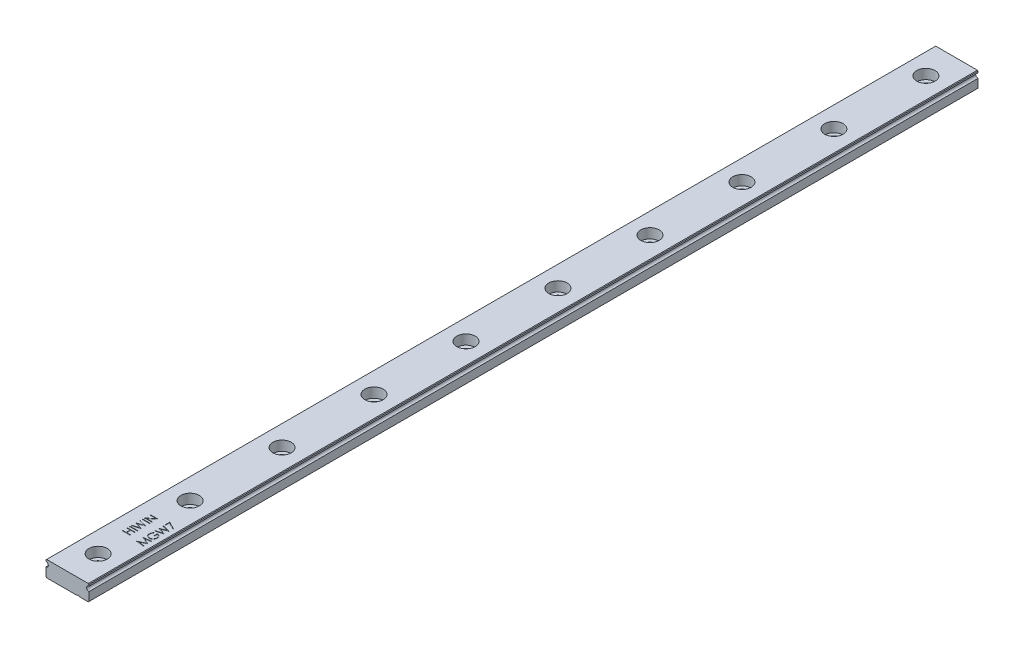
from build123d import *

# Parameters (mm, degrees)
EXTRUDE_1_DEPTH              = 290
HOLE_WIZARD_M3_1_D           = 3.5
HOLE_WIZARD_M3_1_CBORE_D     = 6
HOLE_WIZARD_M3_1_CBORE_DEPTH = 3.2
PATTERN_LINEAR_1_COUNT       = 10
PATTERN_LINEAR_1_PITCH       = 30
SKETCH_4_W                   = 2.5
SKETCH_4_H                   = 0.224358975
SKETCH_4_H_2                 = 0.224358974
CUT_EXTRUDE_1_DEPTH          = 0.1


with BuildPart() as part:
    # Sketch 1 → Extrude 1 (new body)
    with BuildSketch(Plane.XY):
        with BuildLine():
            Line((6.8, 5.2), (-6.8, 5.2))
            Line((-6.8, 5.2), (-7, 5))
            Line((-7, 5), (-7, 4.5))
            ThreePointArc((-7, 4.5), (-6.25, 3.75), (-7, 3))
            Line((-7, 3), (-7, 0.2))
            Line((-7, 0.2), (-6.8, 0))
            Line((-6.8, 0), (3.2, 0))
            ThreePointArc((3.2, 0), (3.5, 0.3), (3.8, 0))
            Line((3.8, 0), (6.8, 0))
            Line((6.8, 0), (7, 0.2))
            Line((7, 0.2), (7, 3))
            ThreePointArc((7, 3), (6.25, 3.75), (7, 4.5))
            Line((7, 4.5), (7, 5))
            Line((7, 5), (6.8, 5.2))
        make_face()
    extrude(amount=-EXTRUDE_1_DEPTH)

    # Hole Wizard M3 _1 (through all)
    with Locations(Plane(origin=(-1.59728338, 5.2, -94.560513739), x_dir=(-1, 0, 0), z_dir=(0, 1, 0))):
        with Locations((-1.59728338, 84.560513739)):
            hole_wizard_m3_1 = CounterBoreHole(HOLE_WIZARD_M3_1_D / 2, HOLE_WIZARD_M3_1_CBORE_D / 2, HOLE_WIZARD_M3_1_CBORE_DEPTH)

    # Pattern Linear 1: Hole Wizard M3 _1 ×10
    with Locations(*[(0, 0, -i * PATTERN_LINEAR_1_PITCH) for i in range(1, PATTERN_LINEAR_1_COUNT)]):
        add(hole_wizard_m3_1, mode=Mode.SUBTRACT)

    # Sketch 4 → Cut-Extrude 1 (cut)
    with BuildSketch(Plane(origin=(0, 5.2, 0), x_dir=(1, 0, 0), z_dir=(0, 1, 0))):
        Polygon((-2.5, 20.384615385), (-2.5, 20.608974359), (-1.474358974, 20.608974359), (-1.474358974, 21.891025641), (-2.5, 21.891025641), (-2.5, 22.115384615), (0, 22.115384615), (0, 21.891025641), (-1.217948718, 21.891025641), (-1.217948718, 20.608974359), (0, 20.608974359), (0, 20.384615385), align=None)
        with Locations((-1.25, 22.868589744)):
            Rectangle(SKETCH_4_W, SKETCH_4_H)
        Polygon((-2.5, 23.365384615), (-2.5, 23.597255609), (-0.666566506, 24.086538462), (-2.5, 24.814202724), (-2.5, 24.846754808), (-0.679086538, 25.560897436), (-2.5, 26.052684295), (-2.5, 26.282051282), (0, 25.607972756), (0, 25.575921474), (-1.912059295, 24.823717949), (0, 24.0625), (0, 24.030448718), align=None)
        with Locations((-1.25, 26.971153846)):
            Rectangle(SKETCH_4_W, SKETCH_4_H_2)
        Polygon((0, 27.628205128), (-2.5, 27.628205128), (-2.5, 27.675280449), (-0.532351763, 29.326923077), (-2.5, 29.326923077), (-2.5, 29.551282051), (0, 29.551282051), (0, 29.500200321), (-1.963141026, 27.852564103), (0, 27.852564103), align=None)
        Polygon((5.262820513, 19.471153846), (2.762820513, 19.801181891), (2.762820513, 19.833233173), (4.814102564, 20.865384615), (2.762820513, 21.895032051), (2.762820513, 21.927584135), (5.262820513, 22.259615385), (5.262820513, 22.034254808), (3.463942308, 21.794871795), (5.262820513, 20.892427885), (5.262820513, 20.841846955), (3.459935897, 19.935897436), (5.262820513, 19.697015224), align=None)
        with BuildLine():
            Line((3.189503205, 25.112179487), (3.371794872, 24.919871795))
            add(Edge.make_bspline(
                [(3.371794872, 24.919871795), (3.33904757, 24.885079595), (3.274333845, 24.816324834), (3.190503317, 24.704039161), (3.117979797, 24.587356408), (3.059411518, 24.466087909), (3.013467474, 24.343413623), (2.980070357, 24.221442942), (2.958920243, 24.100965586), (2.956379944, 24.020848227), (2.955128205, 23.981370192)],
                knots=[0, 0, 0, 0, 1.089067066, 2.152164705, 3.18986567, 4.218445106, 5.218487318, 6.173592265, 7.100032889, 8, 8, 8, 8], degree=3))
            add(Edge.make_bspline(
                [(2.955128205, 23.981370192), (2.955423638, 23.957145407), (2.956013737, 23.908758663), (2.96354532, 23.836885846), (2.974377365, 23.76576682), (2.990050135, 23.695535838), (3.009913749, 23.626056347), (3.03476051, 23.557569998), (3.063728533, 23.489949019), (3.097201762, 23.423830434), (3.133972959, 23.35972991), (3.17472236, 23.299189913), (3.218141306, 23.241821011), (3.265326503, 23.188714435), (3.315815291, 23.139516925), (3.36869841, 23.093323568), (3.425015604, 23.050995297), (3.484535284, 23.013291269), (3.54587275, 22.979242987), (3.608507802, 22.949819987), (3.671858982, 22.924241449), (3.736403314, 22.904760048), (3.801475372, 22.888259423), (3.867416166, 22.876772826), (3.934397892, 22.870275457), (3.979253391, 22.869153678), (4.001802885, 22.868589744)],
                knots=[0, 0, 0, 0, 1.028150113, 2.053633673, 3.06513288, 4.081487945, 5.106702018, 6.131327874, 7.172780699, 8.228344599, 9.276313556, 10.308389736, 11.324843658, 12.329040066, 13.321460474, 14.316307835, 15.308626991, 16.309440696, 17.305625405, 18.28535951, 19.246194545, 20.203493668, 21.145557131, 22.095268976, 23.042464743, 24, 24, 24, 24], degree=3))
            add(Edge.make_bspline(
                [(4.001802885, 22.868589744), (4.024853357, 22.869129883), (4.070891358, 22.870208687), (4.139603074, 22.877103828), (4.207286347, 22.889928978), (4.274047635, 22.906937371), (4.340019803, 22.92856071), (4.405134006, 22.955126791), (4.469383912, 22.986774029), (4.53213171, 23.023324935), (4.593203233, 23.063688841), (4.651212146, 23.108082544), (4.705483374, 23.156580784), (4.756809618, 23.208294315), (4.80486696, 23.263694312), (4.84907614, 23.323318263), (4.890120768, 23.386331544), (4.927549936, 23.452762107), (4.96098377, 23.521907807), (4.990715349, 23.592805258), (5.01520053, 23.665682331), (5.035156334, 23.740155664), (5.051513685, 23.816136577), (5.062036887, 23.89401072), (5.069673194, 23.973205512), (5.07023153, 24.02659025), (5.070512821, 24.053485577)],
                knots=[0, 0, 0, 0, 0.935915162, 1.869274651, 2.799799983, 3.730201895, 4.664668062, 5.616159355, 6.583070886, 7.570012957, 8.562524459, 9.553461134, 10.53281078, 11.515274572, 12.509912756, 13.507571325, 14.526460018, 15.561318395, 16.601025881, 17.643204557, 18.680545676, 19.719612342, 20.772381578, 21.833430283, 22.908478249, 24, 24, 24, 24], degree=3))
            add(Edge.make_bspline(
                [(5.070512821, 24.053485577), (5.069835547, 24.085898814), (5.06850561, 24.149547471), (5.058144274, 24.243107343), (5.041982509, 24.332973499), (5.01824033, 24.418853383), (4.988188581, 24.501058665), (4.95102531, 24.579286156), (4.907141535, 24.653751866), (4.857425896, 24.724133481), (4.802034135, 24.788757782), (4.742795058, 24.847573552), (4.678941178, 24.898558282), (4.611424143, 24.943234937), (4.539598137, 24.98016154), (4.463862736, 25.010480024), (4.384171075, 25.033717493), (4.329105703, 25.043256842), (4.301282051, 25.048076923)],
                knots=[0, 0, 0, 0, 1.130199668, 2.219330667, 3.279027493, 4.311506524, 5.322739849, 6.327972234, 7.327472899, 8.33386792, 9.329086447, 10.29244429, 11.240784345, 12.174119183, 13.111530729, 14.052100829, 15.015757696, 16, 16, 16, 16], degree=3))
            Line((4.301282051, 25.048076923), (4.301282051, 24.21474359))
            Line((4.301282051, 24.21474359), (4.044871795, 24.21474359))
            Line((4.044871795, 24.21474359), (4.044871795, 25.272435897))
            add(Edge.make_bspline(
                [(4.044871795, 25.272435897), (4.092662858, 25.271217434), (4.186198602, 25.268832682), (4.322605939, 25.252104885), (4.451442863, 25.22509309), (4.572845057, 25.188192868), (4.68664048, 25.14042481), (4.79294467, 25.082301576), (4.891070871, 25.012892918), (4.981820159, 24.934671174), (5.062769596, 24.84688549), (5.133916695, 24.751907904), (5.193847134, 24.649581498), (5.24260475, 24.540003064), (5.280657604, 24.423531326), (5.307637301, 24.299896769), (5.323801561, 24.169267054), (5.325866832, 24.079740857), (5.326923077, 24.033954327)],
                knots=[0, 0, 0, 0, 1.140356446, 2.231883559, 3.274166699, 4.278491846, 5.25512956, 6.21435461, 7.1637429, 8.11826594, 9.068280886, 10.0076534, 10.945064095, 11.891975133, 12.864533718, 13.863980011, 14.907571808, 16, 16, 16, 16], degree=3))
            add(Edge.make_bspline(
                [(5.326923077, 24.033954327), (5.326516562, 24.005732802), (5.325714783, 23.950070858), (5.320016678, 23.867863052), (5.311244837, 23.787921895), (5.297998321, 23.710259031), (5.281773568, 23.634588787), (5.26099734, 23.561289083), (5.236948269, 23.490080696), (5.209594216, 23.420853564), (5.177900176, 23.35423603), (5.142679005, 23.289931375), (5.104112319, 23.227584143), (5.061533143, 23.167619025), (5.015259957, 23.109723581), (4.965200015, 23.054271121), (4.911506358, 23.000951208), (4.873378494, 22.967550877), (4.854166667, 22.950721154)],
                knots=[0, 0, 0, 0, 1.107784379, 2.184907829, 3.233506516, 4.263428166, 5.276301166, 6.270063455, 7.25232949, 8.225834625, 9.190232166, 10.146266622, 11.1027726, 12.066435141, 13.031522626, 14.010570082, 14.99756817, 16, 16, 16, 16], degree=3))
            add(Edge.make_bspline(
                [(4.854166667, 22.950721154), (4.823687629, 22.926302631), (4.763235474, 22.877870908), (4.666378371, 22.815529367), (4.566091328, 22.762385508), (4.462095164, 22.719265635), (4.354487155, 22.685595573), (4.243404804, 22.66144825), (4.128705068, 22.647300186), (4.051087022, 22.645261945), (4.01181891, 22.644230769)],
                knots=[0, 0, 0, 0, 1.023165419, 2.029347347, 3.013907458, 3.994755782, 4.975994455, 5.96558838, 6.970761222, 8, 8, 8, 8], degree=3))
            add(Edge.make_bspline(
                [(4.01181891, 22.644230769), (3.982414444, 22.644610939), (3.923979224, 22.645366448), (3.837224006, 22.654527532), (3.752009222, 22.667671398), (3.668404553, 22.686990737), (3.586354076, 22.711345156), (3.50582002, 22.741740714), (3.426753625, 22.777129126), (3.349703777, 22.818264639), (3.275675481, 22.864028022), (3.205031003, 22.913747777), (3.138915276, 22.967807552), (3.077175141, 23.026364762), (3.018895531, 23.088238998), (2.965293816, 23.154729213), (2.915531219, 23.224828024), (2.870563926, 23.299078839), (2.830158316, 23.376310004), (2.79473826, 23.456353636), (2.765464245, 23.539180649), (2.74062589, 23.624171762), (2.722257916, 23.711969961), (2.708937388, 23.801938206), (2.699822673, 23.894545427), (2.699089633, 23.957142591), (2.698717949, 23.988882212)],
                knots=[0, 0, 0, 0, 1.00895651, 2.005089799, 2.991467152, 3.967318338, 4.948153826, 5.927364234, 6.919980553, 7.91976625, 8.923240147, 9.905815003, 10.88314567, 11.851989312, 12.825009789, 13.798721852, 14.781296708, 15.773896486, 16.776076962, 17.771600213, 18.775744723, 19.78957137, 20.808953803, 21.851964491, 22.910847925, 24, 24, 24, 24], degree=3))
            add(Edge.make_bspline(
                [(2.698717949, 23.988882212), (2.699131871, 24.014766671), (2.699952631, 24.066092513), (2.705641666, 24.142468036), (2.714658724, 24.217663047), (2.726963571, 24.29178904), (2.74372335, 24.364593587), (2.763779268, 24.436284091), (2.78713057, 24.506964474), (2.814979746, 24.576413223), (2.846589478, 24.645097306), (2.882170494, 24.713398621), (2.922331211, 24.781083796), (2.96719088, 24.848270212), (3.015979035, 24.915381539), (3.070091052, 24.981356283), (3.12739302, 25.047786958), (3.16859458, 25.090502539), (3.189503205, 25.112179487)],
                knots=[0, 0, 0, 0, 0.985871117, 1.954866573, 2.915460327, 3.869826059, 4.81536089, 5.759505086, 6.70452669, 7.649098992, 8.607881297, 9.583363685, 10.581137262, 11.603961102, 12.659522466, 13.73993555, 14.853081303, 16, 16, 16, 16], degree=3))
        make_face()
        Polygon((2.762820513, 25.625), (2.762820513, 25.856870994), (4.596254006, 26.346153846), (2.762820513, 27.073818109), (2.762820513, 27.106370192), (4.583733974, 27.820512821), (2.762820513, 28.312299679), (2.762820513, 28.541666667), (5.262820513, 27.867588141), (5.262820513, 27.835536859), (3.350761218, 27.083333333), (5.262820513, 26.322115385), (5.262820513, 26.290064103), align=None)
        Polygon((2.762820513, 29.054487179), (2.762820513, 30.592948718), (5.326923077, 29.278846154), (5.220252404, 29.085036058), (3.019230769, 30.213341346), (3.019230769, 29.054487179), align=None)
    extrude(amount=-CUT_EXTRUDE_1_DEPTH, mode=Mode.SUBTRACT)


solid = part.part
